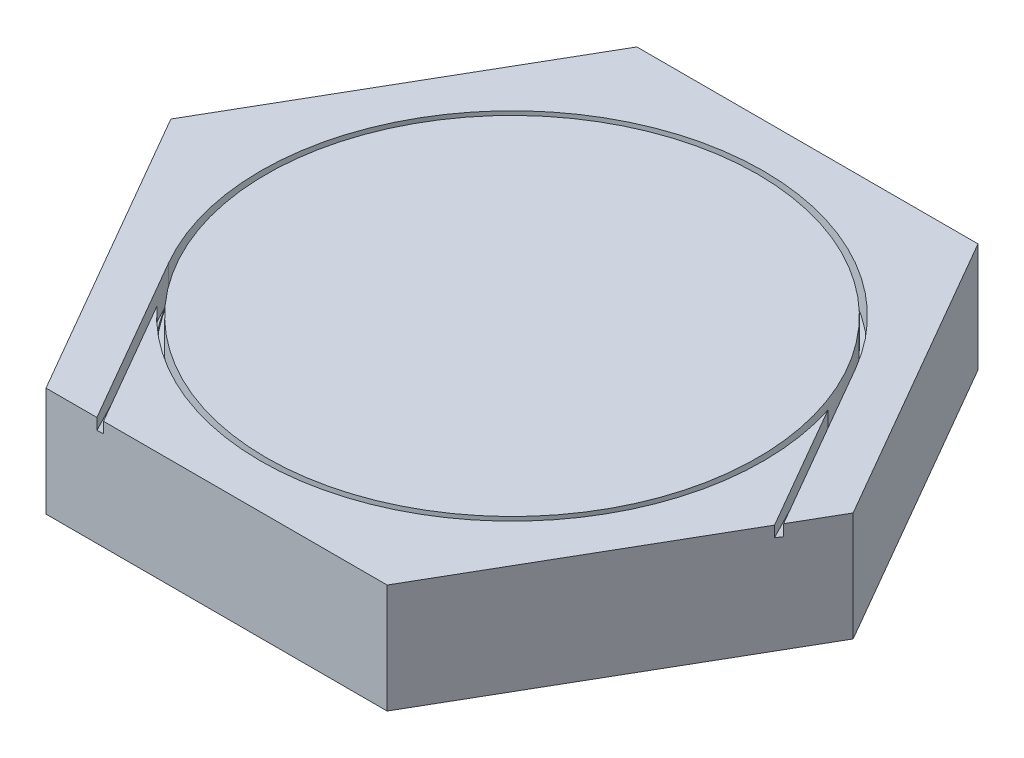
from build123d import *
from build123d.topology import SkipClean

# Parameters (mm, degrees)
BOSS_EXTRUDE1_DEPTH = 20
SKETCH2_R           = 46.05
SKETCH2_R_2         = 45
CUT_EXTRUDE1_DEPTH  = 6
CUT_EXTRUDE3_DEPTH  = 1.05


with BuildPart() as part:
    # Sketch1 → Boss-Extrude1 (new body)
    with BuildSketch(Plane(origin=(0, 0, 0), x_dir=(1, 0, 0), z_dir=(0, 1, 0))):
        Polygon((62.5, 0), (31.25, 54.126587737), (-31.25, 54.126587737), (-62.5, 0), (-31.25, -54.126587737), (31.25, -54.126587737), align=None)
    extrude(amount=BOSS_EXTRUDE1_DEPTH)

    # Sketch2 → Cut-Extrude1 (cut)
    with BuildSketch(Plane(origin=(0, 20, 0), x_dir=(1, 0, 0), z_dir=(0, 1, 0))):
        with Locations(Location((0, 0, 0), (0, 0, 270))):
            Circle(SKETCH2_R)
        with Locations(Location((0, 0, 0), (0, 0, 270))):
            Circle(SKETCH2_R_2, mode=Mode.SUBTRACT)
    extrude(amount=-CUT_EXTRUDE1_DEPTH, mode=Mode.SUBTRACT)

    # Sketch8 → Cut-Extrude3 (cut)
    with SkipClean():  # the faces are left unmerged after this step: merging them gives an invalid solid
        with BuildSketch(Plane(origin=(-38.97114317, 0, 22.5), x_dir=(0.4999999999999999, 0, 0.8660254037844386), z_dir=(-0.8660254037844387, 0, 0.49999999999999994))):
            Polygon((0, 14), (36.519237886, 18), (38.707515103, 18.239684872), (38.707515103, 20), (36.519237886, 20), (0, 20), align=None)
        cut_extrude3 = extrude(amount=CUT_EXTRUDE3_DEPTH, mode=Mode.SUBTRACT)

    # Mirror1: Cut-Extrude3 across plane
    add(cut_extrude3.mirror(Plane(origin=(0, 0, 0), x_dir=(0.4999999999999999, 0, 0.8660254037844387), z_dir=(0.8660254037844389, 0, -0.49999999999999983))), mode=Mode.SUBTRACT)


solid = part.part
